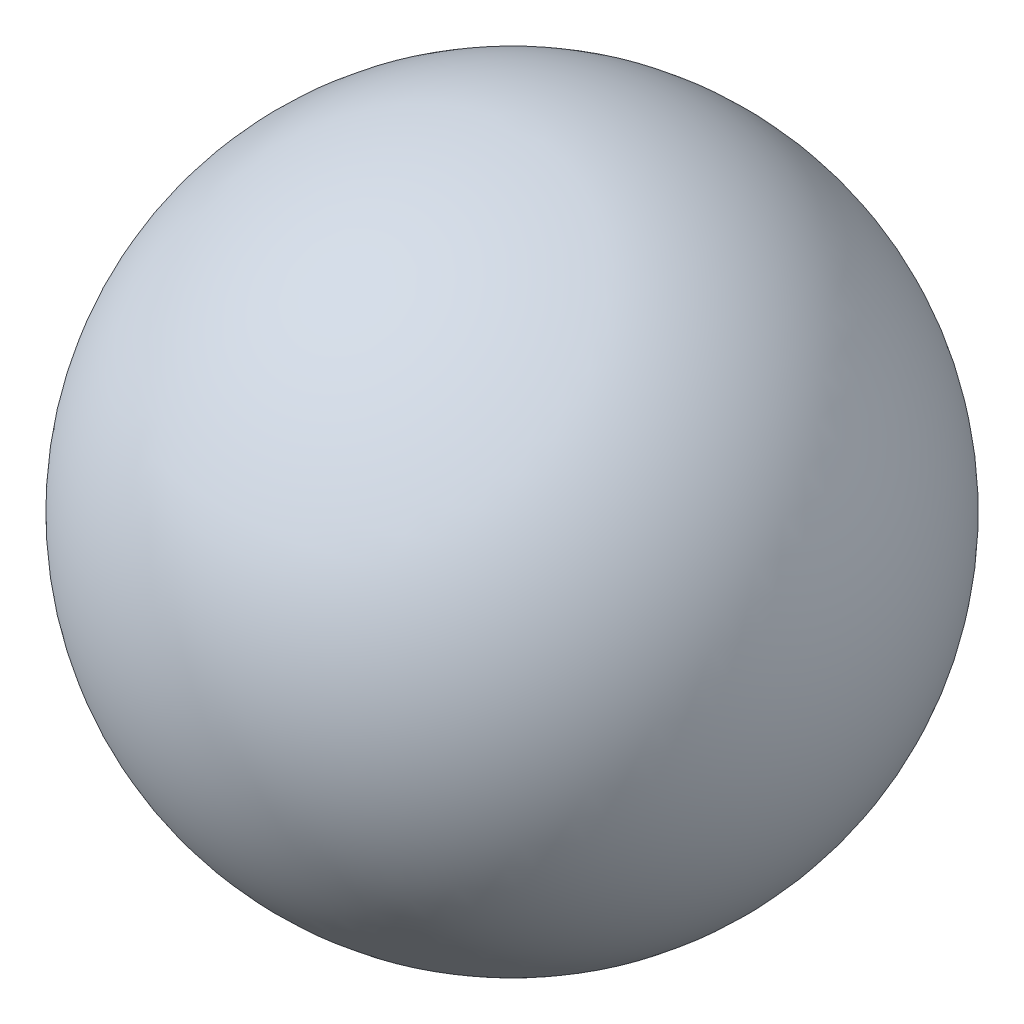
from build123d import *


with BuildPart() as part:
    # Sketch1 → Revolve4 (revolve)
    with BuildSketch(Plane.XY):
        with BuildLine():
            Line((0, 32.512), (0, -32.512))
            ThreePointArc((0, -32.512), (32.512, 0), (0, 32.512))
        make_face()
    revolve(axis=Axis((0, 32.512, 0), (0, -1, 0)))


solid = part.part
